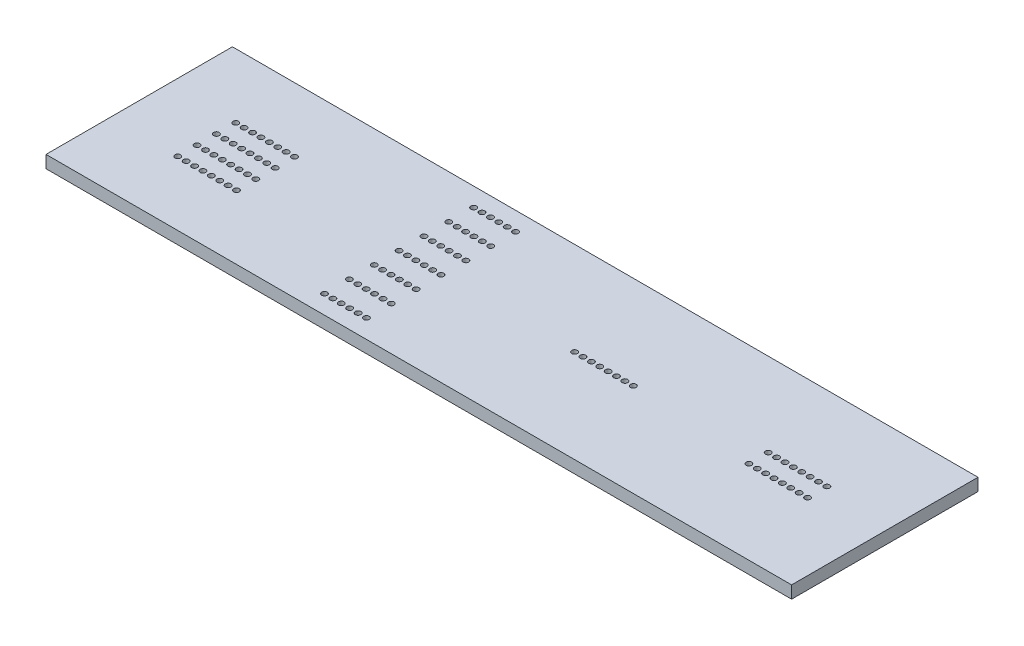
from build123d import *

# Parameters (mm, degrees)
ESQUISSE2_W                     = 120
ESQUISSE2_H                     = 30
BOSS_EXTRU_1_DEPTH              = 2
ENL_V_MAT_EXTRU_3_REACH         = 63.879
ESQUISSE8_R                     = 0.45
R_P_TITION_LIN_AIRE4_COUNT      = 8
R_P_TITION_LIN_AIRE4_PITCH      = 1.35
R_P_TITION_LIN_AIRE4_COUNT_DIR2 = 4
R_P_TITION_LIN_AIRE4_PITCH_DIR2 = 3.111
ENL_V_MAT_EXTRU_4_REACH         = 63.879
ESQUISSE10_R                    = 0.45
R_P_TITION_LIN_AIRE5_COUNT      = 6
R_P_TITION_LIN_AIRE5_PITCH      = 1.35
R_P_TITION_LIN_AIRE5_COUNT_DIR2 = 7
R_P_TITION_LIN_AIRE5_PITCH_DIR2 = 4
ENL_V_MAT_EXTRU_5_REACH         = 63.879
ESQUISSE12_R                    = 0.45
R_P_TITION_LIN_AIRE6_COUNT      = 8
R_P_TITION_LIN_AIRE6_PITCH      = 1.35
ENL_V_MAT_EXTRU_6_REACH         = 63.879
ESQUISSE14_R                    = 0.45
R_P_TITION_LIN_AIRE7_COUNT      = 8
R_P_TITION_LIN_AIRE7_PITCH      = 1.35
R_P_TITION_LIN_AIRE7_COUNT_DIR2 = 2
R_P_TITION_LIN_AIRE7_PITCH_DIR2 = 3.11


with BuildPart() as part:
    # Esquisse2 → Boss.-Extru.1 (new body)
    with BuildSketch(Plane(origin=(0, 0, 0), x_dir=(1, 0, 0), z_dir=(0, 1, 0))):
        Rectangle(ESQUISSE2_W, ESQUISSE2_H)
    extrude(amount=BOSS_EXTRU_1_DEPTH)

    # Esquisse8 → Enl_v. mat.-Extru.3 (cut, up to next)
    with BuildSketch(Plane(origin=(0, 2, 0), x_dir=(1, 0, 0), z_dir=(0, 1, 0)), mode=Mode.PRIVATE) as enl_v_mat_extru_3_sk1:
        with Locations(Location((-49.125, 4.6665, 0), (0, 0, 270))):
            Circle(ESQUISSE8_R)
    enl_v_mat_extru_3_tool1 = extrude(enl_v_mat_extru_3_sk1.sketch, amount=-ENL_V_MAT_EXTRU_3_REACH, mode=Mode.PRIVATE) & part.part
    enl_v_mat_extru_3 = enl_v_mat_extru_3_tool1.solids().sort_by_distance((-49.125, 2, -4.6665))[0]
    add(enl_v_mat_extru_3, mode=Mode.SUBTRACT)

    # R_p_tition lin_aire4: Enl_v. mat.-Extru.3 8 × 4
    with Locations(*[(i * R_P_TITION_LIN_AIRE4_PITCH, 0, j * R_P_TITION_LIN_AIRE4_PITCH_DIR2) for i in range(R_P_TITION_LIN_AIRE4_COUNT) for j in range(R_P_TITION_LIN_AIRE4_COUNT_DIR2) if (i, j) != (0, 0)]):
        add(enl_v_mat_extru_3, mode=Mode.SUBTRACT)

    # Esquisse10 → Enl_v. mat.-Extru.4 (cut, up to next)
    with BuildSketch(Plane(origin=(0, 2, 0), x_dir=(1, 0, 0), z_dir=(0, 1, 0)), mode=Mode.PRIVATE) as enl_v_mat_extru_4_sk1:
        with Locations(Location((-18.175, 12, 0), (0, 0, 270))):
            Circle(ESQUISSE10_R)
    enl_v_mat_extru_4_tool1 = extrude(enl_v_mat_extru_4_sk1.sketch, amount=-ENL_V_MAT_EXTRU_4_REACH, mode=Mode.PRIVATE) & part.part
    enl_v_mat_extru_4 = enl_v_mat_extru_4_tool1.solids().sort_by_distance((-18.175, 2, -12))[0]
    add(enl_v_mat_extru_4, mode=Mode.SUBTRACT)

    # R_p_tition lin_aire5: Enl_v. mat.-Extru.4 6 × 7
    with Locations(*[(i * R_P_TITION_LIN_AIRE5_PITCH, 0, j * R_P_TITION_LIN_AIRE5_PITCH_DIR2) for i in range(R_P_TITION_LIN_AIRE5_COUNT) for j in range(R_P_TITION_LIN_AIRE5_COUNT_DIR2) if (i, j) != (0, 0)]):
        add(enl_v_mat_extru_4, mode=Mode.SUBTRACT)

    # Esquisse12 → Enl_v. mat.-Extru.5 (cut, up to next)
    with BuildSketch(Plane(origin=(0, 2, 0), x_dir=(1, 0, 0), z_dir=(0, 1, 0)), mode=Mode.PRIVATE) as enl_v_mat_extru_5_sk1:
        with Locations(Location((10.075, 0, 0), (0, 0, 270))):
            Circle(ESQUISSE12_R)
    enl_v_mat_extru_5_tool1 = extrude(enl_v_mat_extru_5_sk1.sketch, amount=-ENL_V_MAT_EXTRU_5_REACH, mode=Mode.PRIVATE) & part.part
    enl_v_mat_extru_5 = enl_v_mat_extru_5_tool1.solids().sort_by_distance((10.075, 2, 0))[0]
    add(enl_v_mat_extru_5, mode=Mode.SUBTRACT)

    # R_p_tition lin_aire6: Enl_v. mat.-Extru.5 ×8
    with Locations(*[(i * R_P_TITION_LIN_AIRE6_PITCH, 0, 0) for i in range(1, R_P_TITION_LIN_AIRE6_COUNT)]):
        add(enl_v_mat_extru_5, mode=Mode.SUBTRACT)

    # Esquisse14 → Enl_v. mat.-Extru.6 (cut, up to next)
    with BuildSketch(Plane(origin=(0, 2, 0), x_dir=(1, 0, 0), z_dir=(0, 1, 0)), mode=Mode.PRIVATE) as enl_v_mat_extru_6_sk1:
        with Locations(Location((39.675, 1.555, 0), (0, 0, 270))):
            Circle(ESQUISSE14_R)
    enl_v_mat_extru_6_tool1 = extrude(enl_v_mat_extru_6_sk1.sketch, amount=-ENL_V_MAT_EXTRU_6_REACH, mode=Mode.PRIVATE) & part.part
    enl_v_mat_extru_6 = enl_v_mat_extru_6_tool1.solids().sort_by_distance((39.675, 2, -1.555))[0]
    add(enl_v_mat_extru_6, mode=Mode.SUBTRACT)

    # R_p_tition lin_aire7: Enl_v. mat.-Extru.6 8 × 2
    with Locations(*[(i * R_P_TITION_LIN_AIRE7_PITCH, 0, j * R_P_TITION_LIN_AIRE7_PITCH_DIR2) for i in range(R_P_TITION_LIN_AIRE7_COUNT) for j in range(R_P_TITION_LIN_AIRE7_COUNT_DIR2) if (i, j) != (0, 0)]):
        add(enl_v_mat_extru_6, mode=Mode.SUBTRACT)


solid = part.part
